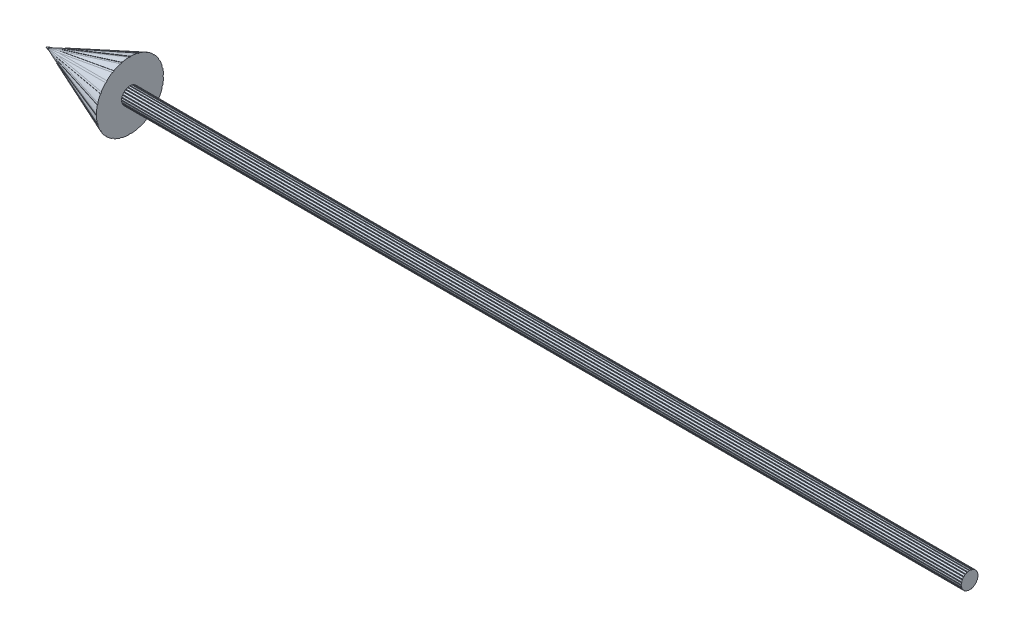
from build123d import *

# Parameters (mm, degrees)
ESQUISSE1_R                  = 0.5
BOSS_EXTRU_1_DEPTH           = 50
ENL_V_MAT_EXTRU_1_DEPTH      = 50
R_P_TITION_CIRCULAIRE1_COUNT = 24
ENL_V_MAT_EXTRU_2_DEPTH      = 0.05
R_P_TITION_CIRCULAIRE2_COUNT = 24


with BuildPart() as part:
    # Esquisse1 → Boss.-Extru.1 (new body)
    with BuildSketch(Plane(origin=(0, 0, 0), x_dir=(0, 0, -1), z_dir=(1, 0, 0))):
        Circle(ESQUISSE1_R)
    extrude(amount=BOSS_EXTRU_1_DEPTH)

    # Esquisse2 → R_volution1 (revolve)
    with BuildSketch(Plane.XY, mode=Mode.PRIVATE) as r_volution1_sk:
        Polygon((0, 0), (0, 2), (-5, 0), align=None)
    revolve(r_volution1_sk.sketch.rotate(Axis((0, 0, 0), (-1, 0, 0)), 90), axis=Axis((0, 0, 0), (-1, 0, 0)))

    # Esquisse3 → Enl_v. mat.-Extru.1 (cut)
    with BuildSketch(Plane(origin=(50, 0, 0), x_dir=(0, 0, -1), z_dir=(1, 0, 0))):
        Polygon((0, 0.48), (-0.05, 0.53), (0.05, 0.53), align=None)
    enl_v_mat_extru_1 = extrude(amount=-ENL_V_MAT_EXTRU_1_DEPTH, mode=Mode.SUBTRACT)

    # R_p_tition circulaire1: Enl_v. mat.-Extru.1 ×24 about axis
    r_p_tition_circulaire1_axis = Axis((0, 0, 0), (1, 0, 0))
    for i in range(1, R_P_TITION_CIRCULAIRE1_COUNT):
        add(enl_v_mat_extru_1.rotate(r_p_tition_circulaire1_axis, i * 360 / R_P_TITION_CIRCULAIRE1_COUNT), mode=Mode.SUBTRACT)

    # Esquisse4 → Enl_v. mat.-Extru.2 (cut, symmetric)
    with BuildSketch(Plane.XY):
        Polygon((0, 1.978459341), (-4.772110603, 0.0696151), (-4.825962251, 0.0696151), (0, 2), align=None)
    enl_v_mat_extru_2 = extrude(amount=ENL_V_MAT_EXTRU_2_DEPTH, both=True, mode=Mode.SUBTRACT)

    # R_p_tition circulaire2: Enl_v. mat.-Extru.2 ×24 about axis
    r_p_tition_circulaire2_axis = Axis((0, 0, 0), (1, 0, 0))
    for i in range(1, R_P_TITION_CIRCULAIRE2_COUNT):
        add(enl_v_mat_extru_2.rotate(r_p_tition_circulaire2_axis, i * 360 / R_P_TITION_CIRCULAIRE2_COUNT), mode=Mode.SUBTRACT)


solid = part.part
